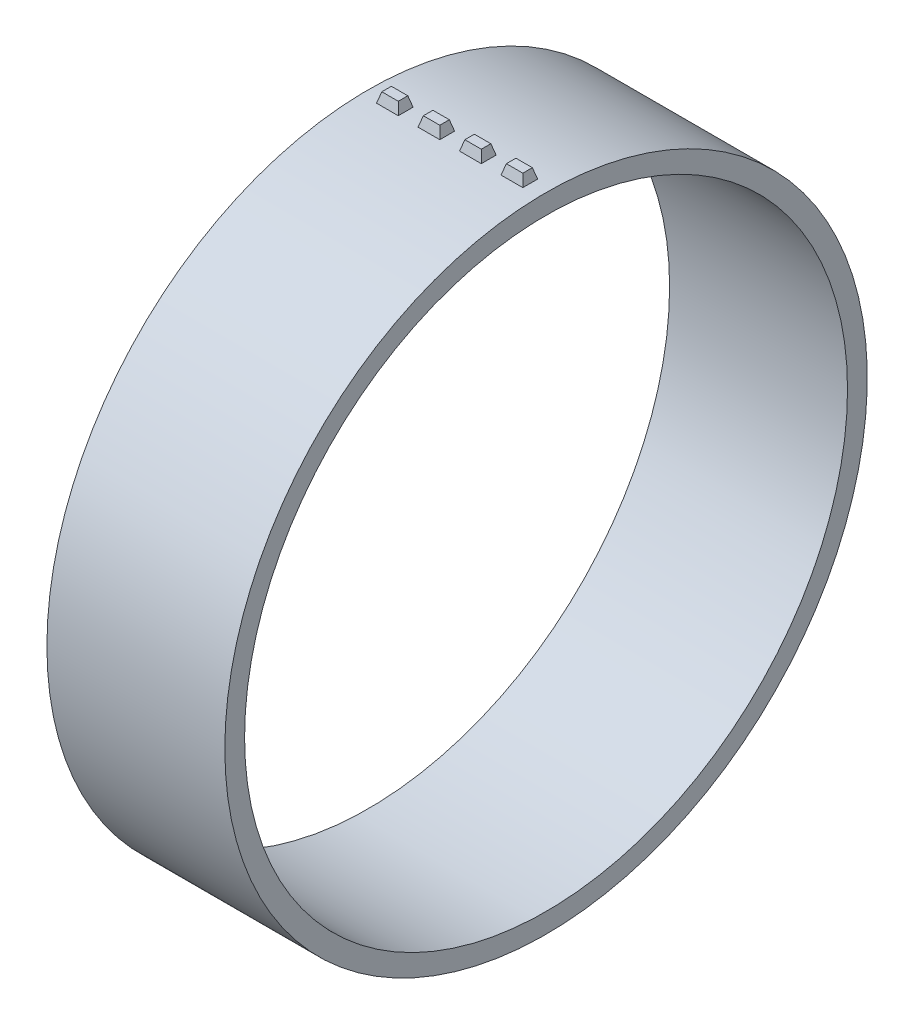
ISO-10303-21;
HEADER;
FILE_DESCRIPTION(('STEP AP214'),'2;1');
FILE_NAME('part.step','',(''),(''),'','','');
FILE_SCHEMA(('AUTOMOTIVE_DESIGN { 1 0 10303 214 1 1 1 1 }'));
ENDSEC;
DATA;
#1=APPLICATION_CONTEXT('core data for automotive mechanical design processes');
#2=APPLICATION_PROTOCOL_DEFINITION('international standard','automotive_design',2000,#1);
#3=PRODUCT_CONTEXT('',#1,'mechanical');
#4=PRODUCT('Part','Part','',(#3));
#5=PRODUCT_RELATED_PRODUCT_CATEGORY('part','',(#4));
#6=PRODUCT_DEFINITION_FORMATION('','',#4);
#7=PRODUCT_DEFINITION_CONTEXT('part definition',#1,'design');
#8=PRODUCT_DEFINITION('design','',#6,#7);
#9=PRODUCT_DEFINITION_SHAPE('','',#8);
#10=(LENGTH_UNIT() NAMED_UNIT(*) SI_UNIT(.MILLI.,.METRE.));
#11=(NAMED_UNIT(*) PLANE_ANGLE_UNIT() SI_UNIT($,.RADIAN.));
#12=(NAMED_UNIT(*) SI_UNIT($,.STERADIAN.) SOLID_ANGLE_UNIT());
#13=UNCERTAINTY_MEASURE_WITH_UNIT(LENGTH_MEASURE(1.E-05),#10,'distance_accuracy_value','');
#14=(GEOMETRIC_REPRESENTATION_CONTEXT(3) GLOBAL_UNCERTAINTY_ASSIGNED_CONTEXT((#13)) GLOBAL_UNIT_ASSIGNED_CONTEXT((#10,
#11,#12)) REPRESENTATION_CONTEXT('',''));
#15=CARTESIAN_POINT('',(0.,0.,0.));
#16=DIRECTION('',(0.,0.,1.));
#17=DIRECTION('',(1.,0.,0.));
#18=AXIS2_PLACEMENT_3D('',#15,#16,#17);
#19=CARTESIAN_POINT('',(32.,325.,-7.5));
#20=DIRECTION('',(0.965925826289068,0.258819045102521,0.));
#21=DIRECTION('',(-0.258819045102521,0.965925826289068,0.));
#22=AXIS2_PLACEMENT_3D('',#19,#20,#21);
#23=PLANE('',#22);
#24=DIRECTION('',(0.,0.,-1.));
#25=VECTOR('',#24,1.);
#26=CARTESIAN_POINT('',(32.,325.,-7.5));
#27=LINE('',#26,#25);
#28=CARTESIAN_POINT('',(32.,325.,7.5));
#29=VERTEX_POINT('',#28);
#30=CARTESIAN_POINT('',(32.,325.,-7.5));
#31=VERTEX_POINT('',#30);
#32=EDGE_CURVE('E92',#29,#31,#27,.T.);
#33=ORIENTED_EDGE('',*,*,#32,.T.);
#34=DIRECTION('',(0.250562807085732,-0.935113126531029,-0.250562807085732));
#35=VECTOR('',#34,1.);
#36=CARTESIAN_POINT('',(32.,325.,-7.5));
#37=LINE('',#36,#35);
#38=CARTESIAN_POINT('',(29.3205080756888,335.,-4.82050807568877));
#39=VERTEX_POINT('',#38);
#40=EDGE_CURVE('E12',#39,#31,#37,.T.);
#41=ORIENTED_EDGE('',*,*,#40,.F.);
#42=DIRECTION('',(0.,0.,1.));
#43=VECTOR('',#42,1.);
#44=CARTESIAN_POINT('',(29.3205080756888,335.,-7.5));
#45=LINE('',#44,#43);
#46=CARTESIAN_POINT('',(29.3205080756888,335.,4.82050807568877));
#47=VERTEX_POINT('',#46);
#48=EDGE_CURVE('E108',#47,#39,#45,.F.);
#49=ORIENTED_EDGE('',*,*,#48,.F.);
#50=DIRECTION('',(0.250562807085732,-0.935113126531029,0.250562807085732));
#51=VECTOR('',#50,1.);
#52=CARTESIAN_POINT('',(31.0582741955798,328.514568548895,6.55827419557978));
#53=LINE('',#52,#51);
#54=EDGE_CURVE('E103',#47,#29,#53,.T.);
#55=ORIENTED_EDGE('',*,*,#54,.T.);
#56=EDGE_LOOP('',(#33,#41,#49,#55));
#57=FACE_BOUND('',#56,.T.);
#58=ADVANCED_FACE('F46',(#57),#23,.T.);
#59=CARTESIAN_POINT('',(32.,325.,-7.5));
#60=DIRECTION('',(0.,0.258819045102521,-0.965925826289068));
#61=DIRECTION('',(0.,0.965925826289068,0.258819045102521));
#62=AXIS2_PLACEMENT_3D('',#59,#60,#61);
#63=PLANE('',#62);
#64=DIRECTION('',(-1.,0.,0.));
#65=VECTOR('',#64,1.);
#66=CARTESIAN_POINT('',(32.,325.,-7.5));
#67=LINE('',#66,#65);
#68=CARTESIAN_POINT('',(10.,325.,-7.5));
#69=VERTEX_POINT('',#68);
#70=EDGE_CURVE('E88',#31,#69,#67,.T.);
#71=ORIENTED_EDGE('',*,*,#70,.T.);
#72=DIRECTION('',(-0.250562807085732,-0.935113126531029,-0.250562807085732));
#73=VECTOR('',#72,1.);
#74=CARTESIAN_POINT('',(10.,325.,-7.5));
#75=LINE('',#74,#73);
#76=CARTESIAN_POINT('',(12.6794919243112,335.,-4.82050807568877));
#77=VERTEX_POINT('',#76);
#78=EDGE_CURVE('E55',#77,#69,#75,.T.);
#79=ORIENTED_EDGE('',*,*,#78,.F.);
#80=DIRECTION('',(1.,0.,0.));
#81=VECTOR('',#80,1.);
#82=CARTESIAN_POINT('',(32.,335.,-4.82050807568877));
#83=LINE('',#82,#81);
#84=EDGE_CURVE('E99',#39,#77,#83,.F.);
#85=ORIENTED_EDGE('',*,*,#84,.F.);
#86=ORIENTED_EDGE('',*,*,#40,.T.);
#87=EDGE_LOOP('',(#71,#79,#85,#86));
#88=FACE_BOUND('',#87,.T.);
#89=ADVANCED_FACE('F48',(#88),#63,.T.);
#90=CARTESIAN_POINT('',(10.,325.,-7.5));
#91=DIRECTION('',(-0.965925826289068,0.258819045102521,0.));
#92=DIRECTION('',(-0.258819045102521,-0.965925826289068,0.));
#93=AXIS2_PLACEMENT_3D('',#90,#91,#92);
#94=PLANE('',#93);
#95=DIRECTION('',(0.,0.,1.));
#96=VECTOR('',#95,1.);
#97=CARTESIAN_POINT('',(10.,325.,-7.5));
#98=LINE('',#97,#96);
#99=CARTESIAN_POINT('',(10.,325.,7.5));
#100=VERTEX_POINT('',#99);
#101=EDGE_CURVE('E93',#69,#100,#98,.T.);
#102=ORIENTED_EDGE('',*,*,#101,.T.);
#103=DIRECTION('',(-0.250562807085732,-0.935113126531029,0.250562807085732));
#104=VECTOR('',#103,1.);
#105=CARTESIAN_POINT('',(11.381197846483,330.154700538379,6.118802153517));
#106=LINE('',#105,#104);
#107=CARTESIAN_POINT('',(12.6794919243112,335.,4.82050807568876));
#108=VERTEX_POINT('',#107);
#109=EDGE_CURVE('E111',#108,#100,#106,.T.);
#110=ORIENTED_EDGE('',*,*,#109,.F.);
#111=DIRECTION('',(0.,0.,-1.));
#112=VECTOR('',#111,1.);
#113=CARTESIAN_POINT('',(12.6794919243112,335.,-7.5));
#114=LINE('',#113,#112);
#115=EDGE_CURVE('E67',#77,#108,#114,.F.);
#116=ORIENTED_EDGE('',*,*,#115,.F.);
#117=ORIENTED_EDGE('',*,*,#78,.T.);
#118=EDGE_LOOP('',(#102,#110,#116,#117));
#119=FACE_BOUND('',#118,.T.);
#120=ADVANCED_FACE('F118',(#119),#94,.T.);
#121=CARTESIAN_POINT('',(32.,325.,7.5));
#122=DIRECTION('',(0.,0.258819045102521,0.965925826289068));
#123=DIRECTION('',(0.,-0.965925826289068,0.258819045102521));
#124=AXIS2_PLACEMENT_3D('',#121,#122,#123);
#125=PLANE('',#124);
#126=DIRECTION('',(1.,0.,0.));
#127=VECTOR('',#126,1.);
#128=CARTESIAN_POINT('',(32.,325.,7.5));
#129=LINE('',#128,#127);
#130=EDGE_CURVE('E107',#100,#29,#129,.T.);
#131=ORIENTED_EDGE('',*,*,#130,.T.);
#132=ORIENTED_EDGE('',*,*,#54,.F.);
#133=DIRECTION('',(-1.,0.,0.));
#134=VECTOR('',#133,1.);
#135=CARTESIAN_POINT('',(32.,335.,4.82050807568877));
#136=LINE('',#135,#134);
#137=EDGE_CURVE('E50',#108,#47,#136,.F.);
#138=ORIENTED_EDGE('',*,*,#137,.F.);
#139=ORIENTED_EDGE('',*,*,#109,.T.);
#140=EDGE_LOOP('',(#131,#132,#138,#139));
#141=FACE_BOUND('',#140,.T.);
#142=ADVANCED_FACE('F120',(#141),#125,.T.);
#143=CARTESIAN_POINT('',(32.,335.,-7.5));
#144=DIRECTION('',(0.,-1.,0.));
#145=DIRECTION('',(0.,0.,-1.));
#146=AXIS2_PLACEMENT_3D('',#143,#144,#145);
#147=PLANE('',#146);
#148=ORIENTED_EDGE('',*,*,#48,.T.);
#149=ORIENTED_EDGE('',*,*,#84,.T.);
#150=ORIENTED_EDGE('',*,*,#115,.T.);
#151=ORIENTED_EDGE('',*,*,#137,.T.);
#152=EDGE_LOOP('',(#148,#149,#150,#151));
#153=FACE_BOUND('',#152,.T.);
#154=ADVANCED_FACE('F116',(#153),#147,.F.);
#155=CARTESIAN_POINT('',(32.,325.,-7.5));
#156=DIRECTION('',(0.,-1.,0.));
#157=DIRECTION('',(0.,0.,-1.));
#158=AXIS2_PLACEMENT_3D('',#155,#156,#157);
#159=PLANE('',#158);
#160=ORIENTED_EDGE('',*,*,#32,.F.);
#161=ORIENTED_EDGE('',*,*,#130,.F.);
#162=ORIENTED_EDGE('',*,*,#101,.F.);
#163=ORIENTED_EDGE('',*,*,#70,.F.);
#164=EDGE_LOOP('',(#160,#161,#162,#163));
#165=FACE_BOUND('',#164,.T.);
#166=ADVANCED_FACE('F89',(#165),#159,.T.);
#167=CLOSED_SHELL('',(#58,#89,#120,#142,#154,#166));
#168=MANIFOLD_SOLID_BREP('B2',#167);
#169=CARTESIAN_POINT('',(74.,325.,7.5));
#170=DIRECTION('',(0.,0.258819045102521,0.965925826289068));
#171=DIRECTION('',(0.,-0.965925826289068,0.258819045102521));
#172=AXIS2_PLACEMENT_3D('',#169,#170,#171);
#173=PLANE('',#172);
#174=DIRECTION('',(1.,0.,0.));
#175=VECTOR('',#174,1.);
#176=CARTESIAN_POINT('',(74.,325.,7.5));
#177=LINE('',#176,#175);
#178=CARTESIAN_POINT('',(52.,325.,7.5));
#179=VERTEX_POINT('',#178);
#180=CARTESIAN_POINT('',(74.,325.,7.5));
#181=VERTEX_POINT('',#180);
#182=EDGE_CURVE('E226',#179,#181,#177,.T.);
#183=ORIENTED_EDGE('',*,*,#182,.T.);
#184=DIRECTION('',(0.250562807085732,-0.935113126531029,0.250562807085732));
#185=VECTOR('',#184,1.);
#186=CARTESIAN_POINT('',(73.0582741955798,328.514568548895,6.55827419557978));
#187=LINE('',#186,#185);
#188=CARTESIAN_POINT('',(71.3205080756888,335.,4.82050807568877));
#189=VERTEX_POINT('',#188);
#190=EDGE_CURVE('E44',#189,#181,#187,.T.);
#191=ORIENTED_EDGE('',*,*,#190,.F.);
#192=DIRECTION('',(-1.,0.,0.));
#193=VECTOR('',#192,1.);
#194=CARTESIAN_POINT('',(74.,335.,4.82050807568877));
#195=LINE('',#194,#193);
#196=CARTESIAN_POINT('',(54.6794919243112,335.,4.82050807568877));
#197=VERTEX_POINT('',#196);
#198=EDGE_CURVE('E242',#197,#189,#195,.F.);
#199=ORIENTED_EDGE('',*,*,#198,.F.);
#200=DIRECTION('',(-0.250562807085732,-0.935113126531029,0.250562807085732));
#201=VECTOR('',#200,1.);
#202=CARTESIAN_POINT('',(53.381197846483,330.154700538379,6.118802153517));
#203=LINE('',#202,#201);
#204=EDGE_CURVE('E237',#197,#179,#203,.T.);
#205=ORIENTED_EDGE('',*,*,#204,.T.);
#206=EDGE_LOOP('',(#183,#191,#199,#205));
#207=FACE_BOUND('',#206,.T.);
#208=ADVANCED_FACE('F180',(#207),#173,.T.);
#209=CARTESIAN_POINT('',(74.,325.,-7.5));
#210=DIRECTION('',(0.965925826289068,0.258819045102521,0.));
#211=DIRECTION('',(-0.258819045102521,0.965925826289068,0.));
#212=AXIS2_PLACEMENT_3D('',#209,#210,#211);
#213=PLANE('',#212);
#214=DIRECTION('',(0.,0.,-1.));
#215=VECTOR('',#214,1.);
#216=CARTESIAN_POINT('',(74.,325.,-7.5));
#217=LINE('',#216,#215);
#218=CARTESIAN_POINT('',(74.,325.,-7.5));
#219=VERTEX_POINT('',#218);
#220=EDGE_CURVE('E222',#181,#219,#217,.T.);
#221=ORIENTED_EDGE('',*,*,#220,.T.);
#222=DIRECTION('',(0.250562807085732,-0.935113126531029,-0.250562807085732));
#223=VECTOR('',#222,1.);
#224=CARTESIAN_POINT('',(74.,325.,-7.5));
#225=LINE('',#224,#223);
#226=CARTESIAN_POINT('',(71.3205080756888,335.,-4.82050807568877));
#227=VERTEX_POINT('',#226);
#228=EDGE_CURVE('E189',#227,#219,#225,.T.);
#229=ORIENTED_EDGE('',*,*,#228,.F.);
#230=DIRECTION('',(0.,0.,1.));
#231=VECTOR('',#230,1.);
#232=CARTESIAN_POINT('',(71.3205080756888,335.,-7.5));
#233=LINE('',#232,#231);
#234=EDGE_CURVE('E233',#189,#227,#233,.F.);
#235=ORIENTED_EDGE('',*,*,#234,.F.);
#236=ORIENTED_EDGE('',*,*,#190,.T.);
#237=EDGE_LOOP('',(#221,#229,#235,#236));
#238=FACE_BOUND('',#237,.T.);
#239=ADVANCED_FACE('F182',(#238),#213,.T.);
#240=CARTESIAN_POINT('',(74.,325.,-7.5));
#241=DIRECTION('',(0.,0.258819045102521,-0.965925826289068));
#242=DIRECTION('',(0.,0.965925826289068,0.258819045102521));
#243=AXIS2_PLACEMENT_3D('',#240,#241,#242);
#244=PLANE('',#243);
#245=DIRECTION('',(-1.,0.,0.));
#246=VECTOR('',#245,1.);
#247=CARTESIAN_POINT('',(74.,325.,-7.5));
#248=LINE('',#247,#246);
#249=CARTESIAN_POINT('',(52.,325.,-7.5));
#250=VERTEX_POINT('',#249);
#251=EDGE_CURVE('E227',#219,#250,#248,.T.);
#252=ORIENTED_EDGE('',*,*,#251,.T.);
#253=DIRECTION('',(-0.250562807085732,-0.935113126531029,-0.250562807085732));
#254=VECTOR('',#253,1.);
#255=CARTESIAN_POINT('',(52.,325.,-7.5));
#256=LINE('',#255,#254);
#257=CARTESIAN_POINT('',(54.6794919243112,335.,-4.82050807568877));
#258=VERTEX_POINT('',#257);
#259=EDGE_CURVE('E245',#258,#250,#256,.T.);
#260=ORIENTED_EDGE('',*,*,#259,.F.);
#261=DIRECTION('',(1.,0.,0.));
#262=VECTOR('',#261,1.);
#263=CARTESIAN_POINT('',(74.,335.,-4.82050807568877));
#264=LINE('',#263,#262);
#265=EDGE_CURVE('E201',#227,#258,#264,.F.);
#266=ORIENTED_EDGE('',*,*,#265,.F.);
#267=ORIENTED_EDGE('',*,*,#228,.T.);
#268=EDGE_LOOP('',(#252,#260,#266,#267));
#269=FACE_BOUND('',#268,.T.);
#270=ADVANCED_FACE('F252',(#269),#244,.T.);
#271=CARTESIAN_POINT('',(52.,325.,-7.5));
#272=DIRECTION('',(-0.965925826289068,0.258819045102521,0.));
#273=DIRECTION('',(-0.258819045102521,-0.965925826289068,0.));
#274=AXIS2_PLACEMENT_3D('',#271,#272,#273);
#275=PLANE('',#274);
#276=DIRECTION('',(0.,0.,1.));
#277=VECTOR('',#276,1.);
#278=CARTESIAN_POINT('',(52.,325.,-7.5));
#279=LINE('',#278,#277);
#280=EDGE_CURVE('E241',#250,#179,#279,.T.);
#281=ORIENTED_EDGE('',*,*,#280,.T.);
#282=ORIENTED_EDGE('',*,*,#204,.F.);
#283=DIRECTION('',(0.,0.,-1.));
#284=VECTOR('',#283,1.);
#285=CARTESIAN_POINT('',(54.6794919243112,335.,-7.5));
#286=LINE('',#285,#284);
#287=EDGE_CURVE('E184',#258,#197,#286,.F.);
#288=ORIENTED_EDGE('',*,*,#287,.F.);
#289=ORIENTED_EDGE('',*,*,#259,.T.);
#290=EDGE_LOOP('',(#281,#282,#288,#289));
#291=FACE_BOUND('',#290,.T.);
#292=ADVANCED_FACE('F254',(#291),#275,.T.);
#293=CARTESIAN_POINT('',(52.,335.,7.5));
#294=DIRECTION('',(0.,1.,0.));
#295=DIRECTION('',(0.,0.,1.));
#296=AXIS2_PLACEMENT_3D('',#293,#294,#295);
#297=PLANE('',#296);
#298=ORIENTED_EDGE('',*,*,#198,.T.);
#299=ORIENTED_EDGE('',*,*,#234,.T.);
#300=ORIENTED_EDGE('',*,*,#265,.T.);
#301=ORIENTED_EDGE('',*,*,#287,.T.);
#302=EDGE_LOOP('',(#298,#299,#300,#301));
#303=FACE_BOUND('',#302,.T.);
#304=ADVANCED_FACE('F250',(#303),#297,.T.);
#305=CARTESIAN_POINT('',(52.,325.,7.5));
#306=DIRECTION('',(0.,1.,0.));
#307=DIRECTION('',(0.,0.,1.));
#308=AXIS2_PLACEMENT_3D('',#305,#306,#307);
#309=PLANE('',#308);
#310=ORIENTED_EDGE('',*,*,#182,.F.);
#311=ORIENTED_EDGE('',*,*,#280,.F.);
#312=ORIENTED_EDGE('',*,*,#251,.F.);
#313=ORIENTED_EDGE('',*,*,#220,.F.);
#314=EDGE_LOOP('',(#310,#311,#312,#313));
#315=FACE_BOUND('',#314,.T.);
#316=ADVANCED_FACE('F223',(#315),#309,.F.);
#317=CLOSED_SHELL('',(#208,#239,#270,#292,#304,#316));
#318=MANIFOLD_SOLID_BREP('B6',#317);
#319=CARTESIAN_POINT('',(-32.,325.,-7.5));
#320=DIRECTION('',(-0.965925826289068,0.258819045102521,0.));
#321=DIRECTION('',(-0.258819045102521,-0.965925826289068,0.));
#322=AXIS2_PLACEMENT_3D('',#319,#320,#321);
#323=PLANE('',#322);
#324=DIRECTION('',(0.,0.,1.));
#325=VECTOR('',#324,1.);
#326=CARTESIAN_POINT('',(-32.,325.,-7.5));
#327=LINE('',#326,#325);
#328=CARTESIAN_POINT('',(-32.,325.,-7.5));
#329=VERTEX_POINT('',#328);
#330=CARTESIAN_POINT('',(-32.,325.,7.5));
#331=VERTEX_POINT('',#330);
#332=EDGE_CURVE('E360',#329,#331,#327,.T.);
#333=ORIENTED_EDGE('',*,*,#332,.T.);
#334=DIRECTION('',(-0.250562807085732,-0.935113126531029,0.250562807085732));
#335=VECTOR('',#334,1.);
#336=CARTESIAN_POINT('',(-32.,325.,7.5));
#337=LINE('',#336,#335);
#338=CARTESIAN_POINT('',(-29.3205080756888,335.,4.82050807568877));
#339=VERTEX_POINT('',#338);
#340=EDGE_CURVE('E178',#339,#331,#337,.T.);
#341=ORIENTED_EDGE('',*,*,#340,.F.);
#342=DIRECTION('',(0.,0.,-1.));
#343=VECTOR('',#342,1.);
#344=CARTESIAN_POINT('',(-29.3205080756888,335.,-7.5));
#345=LINE('',#344,#343);
#346=CARTESIAN_POINT('',(-29.3205080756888,335.,-4.82050807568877));
#347=VERTEX_POINT('',#346);
#348=EDGE_CURVE('E376',#347,#339,#345,.F.);
#349=ORIENTED_EDGE('',*,*,#348,.F.);
#350=DIRECTION('',(-0.250562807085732,-0.935113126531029,-0.250562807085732));
#351=VECTOR('',#350,1.);
#352=CARTESIAN_POINT('',(-32.,325.,-7.5));
#353=LINE('',#352,#351);
#354=EDGE_CURVE('E371',#347,#329,#353,.T.);
#355=ORIENTED_EDGE('',*,*,#354,.T.);
#356=EDGE_LOOP('',(#333,#341,#349,#355));
#357=FACE_BOUND('',#356,.T.);
#358=ADVANCED_FACE('F314',(#357),#323,.T.);
#359=CARTESIAN_POINT('',(-32.,325.,7.5));
#360=DIRECTION('',(0.,0.258819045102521,0.965925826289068));
#361=DIRECTION('',(0.,-0.965925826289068,0.258819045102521));
#362=AXIS2_PLACEMENT_3D('',#359,#360,#361);
#363=PLANE('',#362);
#364=DIRECTION('',(1.,0.,0.));
#365=VECTOR('',#364,1.);
#366=CARTESIAN_POINT('',(-32.,325.,7.5));
#367=LINE('',#366,#365);
#368=CARTESIAN_POINT('',(-10.,325.,7.5));
#369=VERTEX_POINT('',#368);
#370=EDGE_CURVE('E356',#331,#369,#367,.T.);
#371=ORIENTED_EDGE('',*,*,#370,.T.);
#372=DIRECTION('',(0.250562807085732,-0.935113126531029,0.250562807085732));
#373=VECTOR('',#372,1.);
#374=CARTESIAN_POINT('',(-10.9417258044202,328.514568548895,6.55827419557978));
#375=LINE('',#374,#373);
#376=CARTESIAN_POINT('',(-12.6794919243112,335.,4.82050807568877));
#377=VERTEX_POINT('',#376);
#378=EDGE_CURVE('E323',#377,#369,#375,.T.);
#379=ORIENTED_EDGE('',*,*,#378,.F.);
#380=DIRECTION('',(-1.,0.,0.));
#381=VECTOR('',#380,1.);
#382=CARTESIAN_POINT('',(-32.,335.,4.82050807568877));
#383=LINE('',#382,#381);
#384=EDGE_CURVE('E367',#339,#377,#383,.F.);
#385=ORIENTED_EDGE('',*,*,#384,.F.);
#386=ORIENTED_EDGE('',*,*,#340,.T.);
#387=EDGE_LOOP('',(#371,#379,#385,#386));
#388=FACE_BOUND('',#387,.T.);
#389=ADVANCED_FACE('F316',(#388),#363,.T.);
#390=CARTESIAN_POINT('',(-10.,325.,-7.5));
#391=DIRECTION('',(0.965925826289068,0.258819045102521,0.));
#392=DIRECTION('',(-0.258819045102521,0.965925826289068,0.));
#393=AXIS2_PLACEMENT_3D('',#390,#391,#392);
#394=PLANE('',#393);
#395=DIRECTION('',(0.,0.,-1.));
#396=VECTOR('',#395,1.);
#397=CARTESIAN_POINT('',(-10.,325.,-7.5));
#398=LINE('',#397,#396);
#399=CARTESIAN_POINT('',(-10.,325.,-7.5));
#400=VERTEX_POINT('',#399);
#401=EDGE_CURVE('E361',#369,#400,#398,.T.);
#402=ORIENTED_EDGE('',*,*,#401,.T.);
#403=DIRECTION('',(0.250562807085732,-0.935113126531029,-0.250562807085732));
#404=VECTOR('',#403,1.);
#405=CARTESIAN_POINT('',(-11.381197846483,330.154700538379,-6.118802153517));
#406=LINE('',#405,#404);
#407=CARTESIAN_POINT('',(-12.6794919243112,335.,-4.82050807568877));
#408=VERTEX_POINT('',#407);
#409=EDGE_CURVE('E379',#408,#400,#406,.T.);
#410=ORIENTED_EDGE('',*,*,#409,.F.);
#411=DIRECTION('',(0.,0.,1.));
#412=VECTOR('',#411,1.);
#413=CARTESIAN_POINT('',(-12.6794919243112,335.,-7.5));
#414=LINE('',#413,#412);
#415=EDGE_CURVE('E335',#377,#408,#414,.F.);
#416=ORIENTED_EDGE('',*,*,#415,.F.);
#417=ORIENTED_EDGE('',*,*,#378,.T.);
#418=EDGE_LOOP('',(#402,#410,#416,#417));
#419=FACE_BOUND('',#418,.T.);
#420=ADVANCED_FACE('F386',(#419),#394,.T.);
#421=CARTESIAN_POINT('',(-32.,325.,-7.5));
#422=DIRECTION('',(0.,0.258819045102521,-0.965925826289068));
#423=DIRECTION('',(0.,0.965925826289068,0.258819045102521));
#424=AXIS2_PLACEMENT_3D('',#421,#422,#423);
#425=PLANE('',#424);
#426=DIRECTION('',(-1.,0.,0.));
#427=VECTOR('',#426,1.);
#428=CARTESIAN_POINT('',(-32.,325.,-7.5));
#429=LINE('',#428,#427);
#430=EDGE_CURVE('E375',#400,#329,#429,.T.);
#431=ORIENTED_EDGE('',*,*,#430,.T.);
#432=ORIENTED_EDGE('',*,*,#354,.F.);
#433=DIRECTION('',(1.,0.,0.));
#434=VECTOR('',#433,1.);
#435=CARTESIAN_POINT('',(-32.,335.,-4.82050807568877));
#436=LINE('',#435,#434);
#437=EDGE_CURVE('E318',#408,#347,#436,.F.);
#438=ORIENTED_EDGE('',*,*,#437,.F.);
#439=ORIENTED_EDGE('',*,*,#409,.T.);
#440=EDGE_LOOP('',(#431,#432,#438,#439));
#441=FACE_BOUND('',#440,.T.);
#442=ADVANCED_FACE('F388',(#441),#425,.T.);
#443=CARTESIAN_POINT('',(-32.,335.,7.5));
#444=DIRECTION('',(0.,1.,0.));
#445=DIRECTION('',(0.,0.,1.));
#446=AXIS2_PLACEMENT_3D('',#443,#444,#445);
#447=PLANE('',#446);
#448=ORIENTED_EDGE('',*,*,#348,.T.);
#449=ORIENTED_EDGE('',*,*,#384,.T.);
#450=ORIENTED_EDGE('',*,*,#415,.T.);
#451=ORIENTED_EDGE('',*,*,#437,.T.);
#452=EDGE_LOOP('',(#448,#449,#450,#451));
#453=FACE_BOUND('',#452,.T.);
#454=ADVANCED_FACE('F384',(#453),#447,.T.);
#455=CARTESIAN_POINT('',(-32.,325.,7.5));
#456=DIRECTION('',(0.,1.,0.));
#457=DIRECTION('',(0.,0.,1.));
#458=AXIS2_PLACEMENT_3D('',#455,#456,#457);
#459=PLANE('',#458);
#460=ORIENTED_EDGE('',*,*,#332,.F.);
#461=ORIENTED_EDGE('',*,*,#430,.F.);
#462=ORIENTED_EDGE('',*,*,#401,.F.);
#463=ORIENTED_EDGE('',*,*,#370,.F.);
#464=EDGE_LOOP('',(#460,#461,#462,#463));
#465=FACE_BOUND('',#464,.T.);
#466=ADVANCED_FACE('F357',(#465),#459,.F.);
#467=CLOSED_SHELL('',(#358,#389,#420,#442,#454,#466));
#468=MANIFOLD_SOLID_BREP('B38',#467);
#469=CARTESIAN_POINT('',(-74.,325.,-7.5));
#470=DIRECTION('',(-0.965925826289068,0.258819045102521,0.));
#471=DIRECTION('',(-0.258819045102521,-0.965925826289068,0.));
#472=AXIS2_PLACEMENT_3D('',#469,#470,#471);
#473=PLANE('',#472);
#474=DIRECTION('',(0.,0.,1.));
#475=VECTOR('',#474,1.);
#476=CARTESIAN_POINT('',(-74.,325.,-7.5));
#477=LINE('',#476,#475);
#478=CARTESIAN_POINT('',(-74.,325.,-7.5));
#479=VERTEX_POINT('',#478);
#480=CARTESIAN_POINT('',(-74.,325.,7.5));
#481=VERTEX_POINT('',#480);
#482=EDGE_CURVE('E491',#479,#481,#477,.T.);
#483=ORIENTED_EDGE('',*,*,#482,.T.);
#484=DIRECTION('',(-0.250562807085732,-0.935113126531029,0.250562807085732));
#485=VECTOR('',#484,1.);
#486=CARTESIAN_POINT('',(-74.,325.,7.5));
#487=LINE('',#486,#485);
#488=CARTESIAN_POINT('',(-71.3205080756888,335.,4.82050807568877));
#489=VERTEX_POINT('',#488);
#490=EDGE_CURVE('E312',#489,#481,#487,.T.);
#491=ORIENTED_EDGE('',*,*,#490,.F.);
#492=DIRECTION('',(0.,0.,-1.));
#493=VECTOR('',#492,1.);
#494=CARTESIAN_POINT('',(-71.3205080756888,335.,-7.5));
#495=LINE('',#494,#493);
#496=CARTESIAN_POINT('',(-71.3205080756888,335.,-4.82050807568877));
#497=VERTEX_POINT('',#496);
#498=EDGE_CURVE('E507',#497,#489,#495,.F.);
#499=ORIENTED_EDGE('',*,*,#498,.F.);
#500=DIRECTION('',(-0.250562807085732,-0.935113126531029,-0.250562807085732));
#501=VECTOR('',#500,1.);
#502=CARTESIAN_POINT('',(-74.,325.,-7.5));
#503=LINE('',#502,#501);
#504=EDGE_CURVE('E502',#497,#479,#503,.T.);
#505=ORIENTED_EDGE('',*,*,#504,.T.);
#506=EDGE_LOOP('',(#483,#491,#499,#505));
#507=FACE_BOUND('',#506,.T.);
#508=ADVANCED_FACE('F445',(#507),#473,.T.);
#509=CARTESIAN_POINT('',(-74.,325.,7.5));
#510=DIRECTION('',(0.,0.258819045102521,0.965925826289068));
#511=DIRECTION('',(0.,-0.965925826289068,0.258819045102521));
#512=AXIS2_PLACEMENT_3D('',#509,#510,#511);
#513=PLANE('',#512);
#514=DIRECTION('',(1.,0.,0.));
#515=VECTOR('',#514,1.);
#516=CARTESIAN_POINT('',(-74.,325.,7.5));
#517=LINE('',#516,#515);
#518=CARTESIAN_POINT('',(-52.,325.,7.5));
#519=VERTEX_POINT('',#518);
#520=EDGE_CURVE('E487',#481,#519,#517,.T.);
#521=ORIENTED_EDGE('',*,*,#520,.T.);
#522=DIRECTION('',(0.250562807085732,-0.935113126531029,0.250562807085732));
#523=VECTOR('',#522,1.);
#524=CARTESIAN_POINT('',(-52.9417258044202,328.514568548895,6.55827419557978));
#525=LINE('',#524,#523);
#526=CARTESIAN_POINT('',(-54.6794919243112,335.,4.82050807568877));
#527=VERTEX_POINT('',#526);
#528=EDGE_CURVE('E454',#527,#519,#525,.T.);
#529=ORIENTED_EDGE('',*,*,#528,.F.);
#530=DIRECTION('',(-1.,0.,0.));
#531=VECTOR('',#530,1.);
#532=CARTESIAN_POINT('',(-74.,335.,4.82050807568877));
#533=LINE('',#532,#531);
#534=EDGE_CURVE('E498',#489,#527,#533,.F.);
#535=ORIENTED_EDGE('',*,*,#534,.F.);
#536=ORIENTED_EDGE('',*,*,#490,.T.);
#537=EDGE_LOOP('',(#521,#529,#535,#536));
#538=FACE_BOUND('',#537,.T.);
#539=ADVANCED_FACE('F447',(#538),#513,.T.);
#540=CARTESIAN_POINT('',(-52.,325.,-7.5));
#541=DIRECTION('',(0.965925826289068,0.258819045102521,0.));
#542=DIRECTION('',(-0.258819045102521,0.965925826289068,0.));
#543=AXIS2_PLACEMENT_3D('',#540,#541,#542);
#544=PLANE('',#543);
#545=DIRECTION('',(0.,0.,-1.));
#546=VECTOR('',#545,1.);
#547=CARTESIAN_POINT('',(-52.,325.,-7.5));
#548=LINE('',#547,#546);
#549=CARTESIAN_POINT('',(-52.,325.,-7.5));
#550=VERTEX_POINT('',#549);
#551=EDGE_CURVE('E492',#519,#550,#548,.T.);
#552=ORIENTED_EDGE('',*,*,#551,.T.);
#553=DIRECTION('',(0.250562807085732,-0.935113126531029,-0.250562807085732));
#554=VECTOR('',#553,1.);
#555=CARTESIAN_POINT('',(-53.381197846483,330.154700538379,-6.118802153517));
#556=LINE('',#555,#554);
#557=CARTESIAN_POINT('',(-54.6794919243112,335.,-4.82050807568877));
#558=VERTEX_POINT('',#557);
#559=EDGE_CURVE('E510',#558,#550,#556,.T.);
#560=ORIENTED_EDGE('',*,*,#559,.F.);
#561=DIRECTION('',(0.,0.,1.));
#562=VECTOR('',#561,1.);
#563=CARTESIAN_POINT('',(-54.6794919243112,335.,-7.5));
#564=LINE('',#563,#562);
#565=EDGE_CURVE('E466',#527,#558,#564,.F.);
#566=ORIENTED_EDGE('',*,*,#565,.F.);
#567=ORIENTED_EDGE('',*,*,#528,.T.);
#568=EDGE_LOOP('',(#552,#560,#566,#567));
#569=FACE_BOUND('',#568,.T.);
#570=ADVANCED_FACE('F517',(#569),#544,.T.);
#571=CARTESIAN_POINT('',(-74.,325.,-7.5));
#572=DIRECTION('',(0.,0.258819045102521,-0.965925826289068));
#573=DIRECTION('',(0.,0.965925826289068,0.258819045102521));
#574=AXIS2_PLACEMENT_3D('',#571,#572,#573);
#575=PLANE('',#574);
#576=DIRECTION('',(-1.,0.,0.));
#577=VECTOR('',#576,1.);
#578=CARTESIAN_POINT('',(-74.,325.,-7.5));
#579=LINE('',#578,#577);
#580=EDGE_CURVE('E506',#550,#479,#579,.T.);
#581=ORIENTED_EDGE('',*,*,#580,.T.);
#582=ORIENTED_EDGE('',*,*,#504,.F.);
#583=DIRECTION('',(1.,0.,0.));
#584=VECTOR('',#583,1.);
#585=CARTESIAN_POINT('',(-74.,335.,-4.82050807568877));
#586=LINE('',#585,#584);
#587=EDGE_CURVE('E449',#558,#497,#586,.F.);
#588=ORIENTED_EDGE('',*,*,#587,.F.);
#589=ORIENTED_EDGE('',*,*,#559,.T.);
#590=EDGE_LOOP('',(#581,#582,#588,#589));
#591=FACE_BOUND('',#590,.T.);
#592=ADVANCED_FACE('F519',(#591),#575,.T.);
#593=CARTESIAN_POINT('',(-74.,335.,7.5));
#594=DIRECTION('',(0.,1.,0.));
#595=DIRECTION('',(0.,0.,1.));
#596=AXIS2_PLACEMENT_3D('',#593,#594,#595);
#597=PLANE('',#596);
#598=ORIENTED_EDGE('',*,*,#498,.T.);
#599=ORIENTED_EDGE('',*,*,#534,.T.);
#600=ORIENTED_EDGE('',*,*,#565,.T.);
#601=ORIENTED_EDGE('',*,*,#587,.T.);
#602=EDGE_LOOP('',(#598,#599,#600,#601));
#603=FACE_BOUND('',#602,.T.);
#604=ADVANCED_FACE('F515',(#603),#597,.T.);
#605=CARTESIAN_POINT('',(-74.,325.,7.5));
#606=DIRECTION('',(0.,1.,0.));
#607=DIRECTION('',(0.,0.,1.));
#608=AXIS2_PLACEMENT_3D('',#605,#606,#607);
#609=PLANE('',#608);
#610=ORIENTED_EDGE('',*,*,#482,.F.);
#611=ORIENTED_EDGE('',*,*,#580,.F.);
#612=ORIENTED_EDGE('',*,*,#551,.F.);
#613=ORIENTED_EDGE('',*,*,#520,.F.);
#614=EDGE_LOOP('',(#610,#611,#612,#613));
#615=FACE_BOUND('',#614,.T.);
#616=ADVANCED_FACE('F488',(#615),#609,.F.);
#617=CLOSED_SHELL('',(#508,#539,#570,#592,#604,#616));
#618=MANIFOLD_SOLID_BREP('B172',#617);
#619=CARTESIAN_POINT('',(-90.,325.,0.));
#620=DIRECTION('',(1.,0.,0.));
#621=DIRECTION('',(0.,0.,-1.));
#622=AXIS2_PLACEMENT_3D('',#619,#620,#621);
#623=PLANE('',#622);
#624=CARTESIAN_POINT('',(-90.,0.,0.));
#625=DIRECTION('',(-1.,0.,0.));
#626=DIRECTION('',(0.,0.,1.));
#627=AXIS2_PLACEMENT_3D('',#624,#625,#626);
#628=CIRCLE('',#627,305.);
#629=CARTESIAN_POINT('',(-90.,0.,305.));
#630=VERTEX_POINT('',#629);
#631=EDGE_CURVE('E444',#630,#630,#628,.T.);
#632=ORIENTED_EDGE('',*,*,#631,.F.);
#633=EDGE_LOOP('',(#632));
#634=FACE_BOUND('',#633,.T.);
#635=CARTESIAN_POINT('',(-90.,0.,0.));
#636=DIRECTION('',(-1.,0.,0.));
#637=DIRECTION('',(0.,0.,1.));
#638=AXIS2_PLACEMENT_3D('',#635,#636,#637);
#639=CIRCLE('',#638,325.);
#640=CARTESIAN_POINT('',(-90.,0.,325.));
#641=VERTEX_POINT('',#640);
#642=EDGE_CURVE('E583',#641,#641,#639,.T.);
#643=ORIENTED_EDGE('',*,*,#642,.T.);
#644=EDGE_LOOP('',(#643));
#645=FACE_BOUND('',#644,.T.);
#646=ADVANCED_FACE('F569',(#634,#645),#623,.F.);
#647=CARTESIAN_POINT('',(0.,0.,0.));
#648=DIRECTION('',(-1.,0.,0.));
#649=DIRECTION('',(0.,0.,1.));
#650=AXIS2_PLACEMENT_3D('',#647,#648,#649);
#651=CYLINDRICAL_SURFACE('',#650,305.);
#652=CARTESIAN_POINT('',(90.,0.,0.));
#653=DIRECTION('',(-1.,0.,0.));
#654=DIRECTION('',(0.,0.,1.));
#655=AXIS2_PLACEMENT_3D('',#652,#653,#654);
#656=CIRCLE('',#655,305.);
#657=CARTESIAN_POINT('',(90.,0.,305.));
#658=VERTEX_POINT('',#657);
#659=EDGE_CURVE('E575',#658,#658,#656,.T.);
#660=ORIENTED_EDGE('',*,*,#659,.F.);
#661=EDGE_LOOP('',(#660));
#662=FACE_BOUND('',#661,.T.);
#663=ORIENTED_EDGE('',*,*,#631,.T.);
#664=EDGE_LOOP('',(#663));
#665=FACE_BOUND('',#664,.T.);
#666=ADVANCED_FACE('F598',(#662,#665),#651,.F.);
#667=CARTESIAN_POINT('',(90.,325.,0.));
#668=DIRECTION('',(-1.,0.,0.));
#669=DIRECTION('',(0.,0.,1.));
#670=AXIS2_PLACEMENT_3D('',#667,#668,#669);
#671=PLANE('',#670);
#672=CARTESIAN_POINT('',(90.,0.,0.));
#673=DIRECTION('',(-1.,0.,0.));
#674=DIRECTION('',(0.,0.,1.));
#675=AXIS2_PLACEMENT_3D('',#672,#673,#674);
#676=CIRCLE('',#675,325.);
#677=CARTESIAN_POINT('',(90.,0.,325.));
#678=VERTEX_POINT('',#677);
#679=EDGE_CURVE('E579',#678,#678,#676,.T.);
#680=ORIENTED_EDGE('',*,*,#679,.F.);
#681=EDGE_LOOP('',(#680));
#682=FACE_BOUND('',#681,.T.);
#683=ORIENTED_EDGE('',*,*,#659,.T.);
#684=EDGE_LOOP('',(#683));
#685=FACE_BOUND('',#684,.T.);
#686=ADVANCED_FACE('F593',(#682,#685),#671,.F.);
#687=CARTESIAN_POINT('',(0.,0.,0.));
#688=DIRECTION('',(-1.,0.,0.));
#689=DIRECTION('',(0.,0.,1.));
#690=AXIS2_PLACEMENT_3D('',#687,#688,#689);
#691=CYLINDRICAL_SURFACE('',#690,325.);
#692=ORIENTED_EDGE('',*,*,#642,.F.);
#693=EDGE_LOOP('',(#692));
#694=FACE_BOUND('',#693,.T.);
#695=ORIENTED_EDGE('',*,*,#679,.T.);
#696=EDGE_LOOP('',(#695));
#697=FACE_BOUND('',#696,.T.);
#698=ADVANCED_FACE('F590',(#694,#697),#691,.T.);
#699=CLOSED_SHELL('',(#646,#666,#686,#698));
#700=MANIFOLD_SOLID_BREP('B306',#699);
#701=ADVANCED_BREP_SHAPE_REPRESENTATION('',(#18,#168,#318,#468,#618,#700),#14);
#702=SHAPE_DEFINITION_REPRESENTATION(#9,#701);
ENDSEC;
END-ISO-10303-21;
